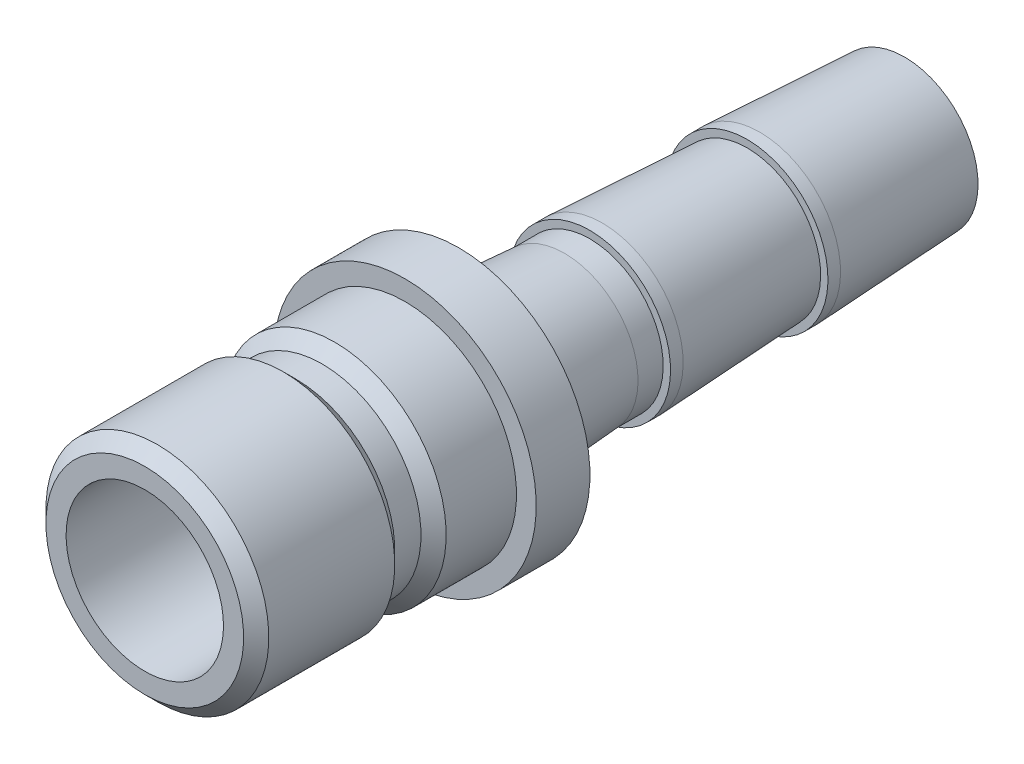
ISO-10303-21;
HEADER;
FILE_DESCRIPTION(('STEP AP214'),'2;1');
FILE_NAME('part.step','',(''),(''),'','','');
FILE_SCHEMA(('AUTOMOTIVE_DESIGN { 1 0 10303 214 1 1 1 1 }'));
ENDSEC;
DATA;
#1=APPLICATION_CONTEXT('core data for automotive mechanical design processes');
#2=APPLICATION_PROTOCOL_DEFINITION('international standard','automotive_design',2000,#1);
#3=PRODUCT_CONTEXT('',#1,'mechanical');
#4=PRODUCT('Part','Part','',(#3));
#5=PRODUCT_RELATED_PRODUCT_CATEGORY('part','',(#4));
#6=PRODUCT_DEFINITION_FORMATION('','',#4);
#7=PRODUCT_DEFINITION_CONTEXT('part definition',#1,'design');
#8=PRODUCT_DEFINITION('design','',#6,#7);
#9=PRODUCT_DEFINITION_SHAPE('','',#8);
#10=(LENGTH_UNIT() NAMED_UNIT(*) SI_UNIT(.MILLI.,.METRE.));
#11=(NAMED_UNIT(*) PLANE_ANGLE_UNIT() SI_UNIT($,.RADIAN.));
#12=(NAMED_UNIT(*) SI_UNIT($,.STERADIAN.) SOLID_ANGLE_UNIT());
#13=UNCERTAINTY_MEASURE_WITH_UNIT(LENGTH_MEASURE(1.E-05),#10,'distance_accuracy_value','');
#14=(GEOMETRIC_REPRESENTATION_CONTEXT(3) GLOBAL_UNCERTAINTY_ASSIGNED_CONTEXT((#13)) GLOBAL_UNIT_ASSIGNED_CONTEXT((#10,
#11,#12)) REPRESENTATION_CONTEXT('',''));
#15=CARTESIAN_POINT('',(0.,0.,0.));
#16=DIRECTION('',(0.,0.,1.));
#17=DIRECTION('',(1.,0.,0.));
#18=AXIS2_PLACEMENT_3D('',#15,#16,#17);
#19=CARTESIAN_POINT('',(0.,0.,0.));
#20=DIRECTION('',(0.,0.,-1.));
#21=DIRECTION('',(0.,1.,0.));
#22=AXIS2_PLACEMENT_3D('',#19,#20,#21);
#23=CYLINDRICAL_SURFACE('',#22,4.7625);
#24=CARTESIAN_POINT('',(0.,0.,3.556));
#25=DIRECTION('',(0.,0.,-1.));
#26=DIRECTION('',(0.,1.,0.));
#27=AXIS2_PLACEMENT_3D('',#24,#25,#26);
#28=CIRCLE('',#27,4.7625);
#29=CARTESIAN_POINT('',(0.,4.7625,3.556));
#30=VERTEX_POINT('',#29);
#31=EDGE_CURVE('E101',#30,#30,#28,.T.);
#32=ORIENTED_EDGE('',*,*,#31,.T.);
#33=EDGE_LOOP('',(#32));
#34=FACE_BOUND('',#33,.T.);
#35=CARTESIAN_POINT('',(0.,0.,15.748));
#36=DIRECTION('',(0.,0.,-1.));
#37=DIRECTION('',(0.,1.,0.));
#38=AXIS2_PLACEMENT_3D('',#35,#36,#37);
#39=CIRCLE('',#38,4.7625);
#40=CARTESIAN_POINT('',(0.,4.7625,15.748));
#41=VERTEX_POINT('',#40);
#42=EDGE_CURVE('E10',#41,#41,#39,.T.);
#43=ORIENTED_EDGE('',*,*,#42,.F.);
#44=EDGE_LOOP('',(#43));
#45=FACE_BOUND('',#44,.T.);
#46=ADVANCED_FACE('F31',(#34,#45),#23,.F.);
#47=CARTESIAN_POINT('',(0.,4.7625,15.748));
#48=DIRECTION('',(0.,0.,1.));
#49=DIRECTION('',(0.,-1.,0.));
#50=AXIS2_PLACEMENT_3D('',#47,#48,#49);
#51=PLANE('',#50);
#52=ORIENTED_EDGE('',*,*,#42,.T.);
#53=EDGE_LOOP('',(#52));
#54=FACE_BOUND('',#53,.T.);
#55=CARTESIAN_POINT('',(0.,0.,15.748));
#56=DIRECTION('',(0.,0.,-1.));
#57=DIRECTION('',(0.,1.,0.));
#58=AXIS2_PLACEMENT_3D('',#55,#56,#57);
#59=CIRCLE('',#58,5.9817);
#60=CARTESIAN_POINT('',(0.,5.9817,15.748));
#61=VERTEX_POINT('',#60);
#62=EDGE_CURVE('E37',#61,#61,#59,.T.);
#63=ORIENTED_EDGE('',*,*,#62,.F.);
#64=EDGE_LOOP('',(#63));
#65=FACE_BOUND('',#64,.T.);
#66=ADVANCED_FACE('F119',(#54,#65),#51,.T.);
#67=CARTESIAN_POINT('',(0.,0.,14.986));
#68=DIRECTION('',(0.,0.,-1.));
#69=DIRECTION('',(0.,1.,0.));
#70=AXIS2_PLACEMENT_3D('',#67,#68,#69);
#71=CONICAL_SURFACE('',#70,6.7437,0.785398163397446);
#72=ORIENTED_EDGE('',*,*,#62,.T.);
#73=EDGE_LOOP('',(#72));
#74=FACE_BOUND('',#73,.T.);
#75=CARTESIAN_POINT('',(0.,0.,14.986));
#76=DIRECTION('',(0.,0.,-1.));
#77=DIRECTION('',(0.,1.,0.));
#78=AXIS2_PLACEMENT_3D('',#75,#76,#77);
#79=CIRCLE('',#78,6.7437);
#80=CARTESIAN_POINT('',(0.,6.7437,14.986));
#81=VERTEX_POINT('',#80);
#82=EDGE_CURVE('E41',#81,#81,#79,.T.);
#83=ORIENTED_EDGE('',*,*,#82,.F.);
#84=EDGE_LOOP('',(#83));
#85=FACE_BOUND('',#84,.T.);
#86=ADVANCED_FACE('F123',(#74,#85),#71,.T.);
#87=CARTESIAN_POINT('',(0.,0.,0.));
#88=DIRECTION('',(0.,0.,-1.));
#89=DIRECTION('',(0.,1.,0.));
#90=AXIS2_PLACEMENT_3D('',#87,#88,#89);
#91=CYLINDRICAL_SURFACE('',#90,6.7437);
#92=ORIENTED_EDGE('',*,*,#82,.T.);
#93=EDGE_LOOP('',(#92));
#94=FACE_BOUND('',#93,.T.);
#95=CARTESIAN_POINT('',(0.,0.,7.36599999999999));
#96=DIRECTION('',(0.,0.,-1.));
#97=DIRECTION('',(0.,1.,0.));
#98=AXIS2_PLACEMENT_3D('',#95,#96,#97);
#99=CIRCLE('',#98,6.7437);
#100=CARTESIAN_POINT('',(0.,6.7437,7.36599999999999));
#101=VERTEX_POINT('',#100);
#102=EDGE_CURVE('E45',#101,#101,#99,.T.);
#103=ORIENTED_EDGE('',*,*,#102,.F.);
#104=EDGE_LOOP('',(#103));
#105=FACE_BOUND('',#104,.T.);
#106=ADVANCED_FACE('F127',(#94,#105),#91,.T.);
#107=CARTESIAN_POINT('',(0.,0.,6.604));
#108=DIRECTION('',(0.,0.,1.));
#109=DIRECTION('',(0.,-1.,0.));
#110=AXIS2_PLACEMENT_3D('',#107,#108,#109);
#111=CONICAL_SURFACE('',#110,5.9817,0.785398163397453);
#112=ORIENTED_EDGE('',*,*,#102,.T.);
#113=EDGE_LOOP('',(#112));
#114=FACE_BOUND('',#113,.T.);
#115=CARTESIAN_POINT('',(0.,0.,6.604));
#116=DIRECTION('',(0.,0.,-1.));
#117=DIRECTION('',(0.,1.,0.));
#118=AXIS2_PLACEMENT_3D('',#115,#116,#117);
#119=CIRCLE('',#118,5.9817);
#120=CARTESIAN_POINT('',(0.,5.9817,6.604));
#121=VERTEX_POINT('',#120);
#122=EDGE_CURVE('E50',#121,#121,#119,.T.);
#123=ORIENTED_EDGE('',*,*,#122,.F.);
#124=EDGE_LOOP('',(#123));
#125=FACE_BOUND('',#124,.T.);
#126=ADVANCED_FACE('F133',(#114,#125),#111,.T.);
#127=CARTESIAN_POINT('',(0.,0.,0.));
#128=DIRECTION('',(0.,0.,-1.));
#129=DIRECTION('',(0.,1.,0.));
#130=AXIS2_PLACEMENT_3D('',#127,#128,#129);
#131=CYLINDRICAL_SURFACE('',#130,5.9817);
#132=ORIENTED_EDGE('',*,*,#122,.T.);
#133=EDGE_LOOP('',(#132));
#134=FACE_BOUND('',#133,.T.);
#135=CARTESIAN_POINT('',(0.,0.,5.0165));
#136=DIRECTION('',(0.,0.,-1.));
#137=DIRECTION('',(0.,1.,0.));
#138=AXIS2_PLACEMENT_3D('',#135,#136,#137);
#139=CIRCLE('',#138,5.9817);
#140=CARTESIAN_POINT('',(0.,5.9817,5.0165));
#141=VERTEX_POINT('',#140);
#142=EDGE_CURVE('E53',#141,#141,#139,.T.);
#143=ORIENTED_EDGE('',*,*,#142,.F.);
#144=EDGE_LOOP('',(#143));
#145=FACE_BOUND('',#144,.T.);
#146=ADVANCED_FACE('F137',(#134,#145),#131,.T.);
#147=CARTESIAN_POINT('',(0.,0.,4.25449999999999));
#148=DIRECTION('',(0.,0.,-1.));
#149=DIRECTION('',(0.,1.,0.));
#150=AXIS2_PLACEMENT_3D('',#147,#148,#149);
#151=CONICAL_SURFACE('',#150,6.7437,0.785398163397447);
#152=ORIENTED_EDGE('',*,*,#142,.T.);
#153=EDGE_LOOP('',(#152));
#154=FACE_BOUND('',#153,.T.);
#155=CARTESIAN_POINT('',(0.,0.,4.25449999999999));
#156=DIRECTION('',(0.,0.,-1.));
#157=DIRECTION('',(0.,1.,0.));
#158=AXIS2_PLACEMENT_3D('',#155,#156,#157);
#159=CIRCLE('',#158,6.7437);
#160=CARTESIAN_POINT('',(0.,6.7437,4.25449999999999));
#161=VERTEX_POINT('',#160);
#162=EDGE_CURVE('E56',#161,#161,#159,.T.);
#163=ORIENTED_EDGE('',*,*,#162,.F.);
#164=EDGE_LOOP('',(#163));
#165=FACE_BOUND('',#164,.T.);
#166=ADVANCED_FACE('F141',(#154,#165),#151,.T.);
#167=CARTESIAN_POINT('',(0.,0.,0.));
#168=DIRECTION('',(0.,0.,-1.));
#169=DIRECTION('',(0.,1.,0.));
#170=AXIS2_PLACEMENT_3D('',#167,#168,#169);
#171=CYLINDRICAL_SURFACE('',#170,6.7437);
#172=ORIENTED_EDGE('',*,*,#162,.T.);
#173=EDGE_LOOP('',(#172));
#174=FACE_BOUND('',#173,.T.);
#175=CARTESIAN_POINT('',(0.,0.,0.));
#176=DIRECTION('',(0.,0.,-1.));
#177=DIRECTION('',(0.,1.,0.));
#178=AXIS2_PLACEMENT_3D('',#175,#176,#177);
#179=CIRCLE('',#178,6.7437);
#180=CARTESIAN_POINT('',(0.,6.7437,0.));
#181=VERTEX_POINT('',#180);
#182=EDGE_CURVE('E59',#181,#181,#179,.T.);
#183=ORIENTED_EDGE('',*,*,#182,.F.);
#184=EDGE_LOOP('',(#183));
#185=FACE_BOUND('',#184,.T.);
#186=ADVANCED_FACE('F145',(#174,#185),#171,.T.);
#187=CARTESIAN_POINT('',(0.,6.7437,0.));
#188=DIRECTION('',(0.,0.,1.));
#189=DIRECTION('',(0.,-1.,0.));
#190=AXIS2_PLACEMENT_3D('',#187,#188,#189);
#191=PLANE('',#190);
#192=ORIENTED_EDGE('',*,*,#182,.T.);
#193=EDGE_LOOP('',(#192));
#194=FACE_BOUND('',#193,.T.);
#195=CARTESIAN_POINT('',(0.,0.,0.));
#196=DIRECTION('',(0.,0.,-1.));
#197=DIRECTION('',(0.,1.,0.));
#198=AXIS2_PLACEMENT_3D('',#195,#196,#197);
#199=CIRCLE('',#198,7.9375);
#200=CARTESIAN_POINT('',(0.,7.9375,0.));
#201=VERTEX_POINT('',#200);
#202=EDGE_CURVE('E62',#201,#201,#199,.T.);
#203=ORIENTED_EDGE('',*,*,#202,.F.);
#204=EDGE_LOOP('',(#203));
#205=FACE_BOUND('',#204,.T.);
#206=ADVANCED_FACE('F149',(#194,#205),#191,.T.);
#207=CARTESIAN_POINT('',(0.,0.,0.));
#208=DIRECTION('',(0.,0.,-1.));
#209=DIRECTION('',(0.,1.,0.));
#210=AXIS2_PLACEMENT_3D('',#207,#208,#209);
#211=CYLINDRICAL_SURFACE('',#210,7.9375);
#212=ORIENTED_EDGE('',*,*,#202,.T.);
#213=EDGE_LOOP('',(#212));
#214=FACE_BOUND('',#213,.T.);
#215=CARTESIAN_POINT('',(0.,0.,-3.2512));
#216=DIRECTION('',(0.,0.,-1.));
#217=DIRECTION('',(0.,1.,0.));
#218=AXIS2_PLACEMENT_3D('',#215,#216,#217);
#219=CIRCLE('',#218,7.9375);
#220=CARTESIAN_POINT('',(0.,7.9375,-3.2512));
#221=VERTEX_POINT('',#220);
#222=EDGE_CURVE('E65',#221,#221,#219,.T.);
#223=ORIENTED_EDGE('',*,*,#222,.F.);
#224=EDGE_LOOP('',(#223));
#225=FACE_BOUND('',#224,.T.);
#226=ADVANCED_FACE('F153',(#214,#225),#211,.T.);
#227=CARTESIAN_POINT('',(0.,4.8895,-3.2512));
#228=DIRECTION('',(0.,0.,-1.));
#229=DIRECTION('',(0.,1.,0.));
#230=AXIS2_PLACEMENT_3D('',#227,#228,#229);
#231=PLANE('',#230);
#232=ORIENTED_EDGE('',*,*,#222,.T.);
#233=EDGE_LOOP('',(#232));
#234=FACE_BOUND('',#233,.T.);
#235=CARTESIAN_POINT('',(0.,0.,-3.2512));
#236=DIRECTION('',(0.,0.,-1.));
#237=DIRECTION('',(0.,1.,0.));
#238=AXIS2_PLACEMENT_3D('',#235,#236,#237);
#239=CIRCLE('',#238,4.8895);
#240=CARTESIAN_POINT('',(0.,4.8895,-3.2512));
#241=VERTEX_POINT('',#240);
#242=EDGE_CURVE('E68',#241,#241,#239,.T.);
#243=ORIENTED_EDGE('',*,*,#242,.F.);
#244=EDGE_LOOP('',(#243));
#245=FACE_BOUND('',#244,.T.);
#246=ADVANCED_FACE('F157',(#234,#245),#231,.T.);
#247=CARTESIAN_POINT('',(0.,0.,-9.652));
#248=DIRECTION('',(0.,0.,1.));
#249=DIRECTION('',(0.,-1.,0.));
#250=AXIS2_PLACEMENT_3D('',#247,#248,#249);
#251=CONICAL_SURFACE('',#250,4.445,0.0693331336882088);
#252=ORIENTED_EDGE('',*,*,#242,.T.);
#253=EDGE_LOOP('',(#252));
#254=FACE_BOUND('',#253,.T.);
#255=CARTESIAN_POINT('',(0.,0.,-9.652));
#256=DIRECTION('',(0.,0.,-1.));
#257=DIRECTION('',(0.,1.,0.));
#258=AXIS2_PLACEMENT_3D('',#255,#256,#257);
#259=CIRCLE('',#258,4.445);
#260=CARTESIAN_POINT('',(0.,4.445,-9.652));
#261=VERTEX_POINT('',#260);
#262=EDGE_CURVE('E71',#261,#261,#259,.T.);
#263=ORIENTED_EDGE('',*,*,#262,.F.);
#264=EDGE_LOOP('',(#263));
#265=FACE_BOUND('',#264,.T.);
#266=ADVANCED_FACE('F161',(#254,#265),#251,.T.);
#267=CARTESIAN_POINT('',(0.,0.,0.));
#268=DIRECTION('',(0.,0.,-1.));
#269=DIRECTION('',(0.,1.,0.));
#270=AXIS2_PLACEMENT_3D('',#267,#268,#269);
#271=CYLINDRICAL_SURFACE('',#270,4.445);
#272=ORIENTED_EDGE('',*,*,#262,.T.);
#273=EDGE_LOOP('',(#272));
#274=FACE_BOUND('',#273,.T.);
#275=CARTESIAN_POINT('',(0.,0.,-11.176));
#276=DIRECTION('',(0.,0.,-1.));
#277=DIRECTION('',(0.,1.,0.));
#278=AXIS2_PLACEMENT_3D('',#275,#276,#277);
#279=CIRCLE('',#278,4.445);
#280=CARTESIAN_POINT('',(0.,4.445,-11.176));
#281=VERTEX_POINT('',#280);
#282=EDGE_CURVE('E74',#281,#281,#279,.T.);
#283=ORIENTED_EDGE('',*,*,#282,.F.);
#284=EDGE_LOOP('',(#283));
#285=FACE_BOUND('',#284,.T.);
#286=ADVANCED_FACE('F165',(#274,#285),#271,.T.);
#287=CARTESIAN_POINT('',(0.,4.8895,-11.176));
#288=DIRECTION('',(0.,0.,1.));
#289=DIRECTION('',(0.,-1.,0.));
#290=AXIS2_PLACEMENT_3D('',#287,#288,#289);
#291=PLANE('',#290);
#292=ORIENTED_EDGE('',*,*,#282,.T.);
#293=EDGE_LOOP('',(#292));
#294=FACE_BOUND('',#293,.T.);
#295=CARTESIAN_POINT('',(0.,0.,-11.176));
#296=DIRECTION('',(0.,0.,-1.));
#297=DIRECTION('',(0.,1.,0.));
#298=AXIS2_PLACEMENT_3D('',#295,#296,#297);
#299=CIRCLE('',#298,4.8895);
#300=CARTESIAN_POINT('',(0.,4.8895,-11.176));
#301=VERTEX_POINT('',#300);
#302=EDGE_CURVE('E77',#301,#301,#299,.T.);
#303=ORIENTED_EDGE('',*,*,#302,.F.);
#304=EDGE_LOOP('',(#303));
#305=FACE_BOUND('',#304,.T.);
#306=ADVANCED_FACE('F169',(#294,#305),#291,.T.);
#307=CARTESIAN_POINT('',(0.,0.,0.));
#308=DIRECTION('',(0.,0.,-1.));
#309=DIRECTION('',(0.,1.,0.));
#310=AXIS2_PLACEMENT_3D('',#307,#308,#309);
#311=CYLINDRICAL_SURFACE('',#310,4.8895);
#312=ORIENTED_EDGE('',*,*,#302,.T.);
#313=EDGE_LOOP('',(#312));
#314=FACE_BOUND('',#313,.T.);
#315=CARTESIAN_POINT('',(0.,0.,-11.938));
#316=DIRECTION('',(0.,0.,-1.));
#317=DIRECTION('',(0.,1.,0.));
#318=AXIS2_PLACEMENT_3D('',#315,#316,#317);
#319=CIRCLE('',#318,4.8895);
#320=CARTESIAN_POINT('',(0.,4.8895,-11.938));
#321=VERTEX_POINT('',#320);
#322=EDGE_CURVE('E80',#321,#321,#319,.T.);
#323=ORIENTED_EDGE('',*,*,#322,.F.);
#324=EDGE_LOOP('',(#323));
#325=FACE_BOUND('',#324,.T.);
#326=ADVANCED_FACE('F173',(#314,#325),#311,.T.);
#327=CARTESIAN_POINT('',(0.,0.,-20.701));
#328=DIRECTION('',(0.,0.,1.));
#329=DIRECTION('',(0.,-1.,0.));
#330=AXIS2_PLACEMENT_3D('',#327,#328,#329);
#331=CONICAL_SURFACE('',#330,4.445,0.0506812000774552);
#332=ORIENTED_EDGE('',*,*,#322,.T.);
#333=EDGE_LOOP('',(#332));
#334=FACE_BOUND('',#333,.T.);
#335=CARTESIAN_POINT('',(0.,0.,-20.701));
#336=DIRECTION('',(0.,0.,-1.));
#337=DIRECTION('',(0.,1.,0.));
#338=AXIS2_PLACEMENT_3D('',#335,#336,#337);
#339=CIRCLE('',#338,4.445);
#340=CARTESIAN_POINT('',(0.,4.445,-20.701));
#341=VERTEX_POINT('',#340);
#342=EDGE_CURVE('E83',#341,#341,#339,.T.);
#343=ORIENTED_EDGE('',*,*,#342,.F.);
#344=EDGE_LOOP('',(#343));
#345=FACE_BOUND('',#344,.T.);
#346=ADVANCED_FACE('F177',(#334,#345),#331,.T.);
#347=CARTESIAN_POINT('',(0.,4.8895,-20.701));
#348=DIRECTION('',(0.,0.,1.));
#349=DIRECTION('',(0.,-1.,0.));
#350=AXIS2_PLACEMENT_3D('',#347,#348,#349);
#351=PLANE('',#350);
#352=ORIENTED_EDGE('',*,*,#342,.T.);
#353=EDGE_LOOP('',(#352));
#354=FACE_BOUND('',#353,.T.);
#355=CARTESIAN_POINT('',(0.,0.,-20.701));
#356=DIRECTION('',(0.,0.,-1.));
#357=DIRECTION('',(0.,1.,0.));
#358=AXIS2_PLACEMENT_3D('',#355,#356,#357);
#359=CIRCLE('',#358,4.8895);
#360=CARTESIAN_POINT('',(0.,4.8895,-20.701));
#361=VERTEX_POINT('',#360);
#362=EDGE_CURVE('E86',#361,#361,#359,.T.);
#363=ORIENTED_EDGE('',*,*,#362,.F.);
#364=EDGE_LOOP('',(#363));
#365=FACE_BOUND('',#364,.T.);
#366=ADVANCED_FACE('F181',(#354,#365),#351,.T.);
#367=CARTESIAN_POINT('',(0.,0.,0.));
#368=DIRECTION('',(0.,0.,-1.));
#369=DIRECTION('',(0.,1.,0.));
#370=AXIS2_PLACEMENT_3D('',#367,#368,#369);
#371=CYLINDRICAL_SURFACE('',#370,4.8895);
#372=ORIENTED_EDGE('',*,*,#362,.T.);
#373=EDGE_LOOP('',(#372));
#374=FACE_BOUND('',#373,.T.);
#375=CARTESIAN_POINT('',(0.,0.,-21.463));
#376=DIRECTION('',(0.,0.,-1.));
#377=DIRECTION('',(0.,1.,0.));
#378=AXIS2_PLACEMENT_3D('',#375,#376,#377);
#379=CIRCLE('',#378,4.8895);
#380=CARTESIAN_POINT('',(0.,4.8895,-21.463));
#381=VERTEX_POINT('',#380);
#382=EDGE_CURVE('E89',#381,#381,#379,.T.);
#383=ORIENTED_EDGE('',*,*,#382,.F.);
#384=EDGE_LOOP('',(#383));
#385=FACE_BOUND('',#384,.T.);
#386=ADVANCED_FACE('F185',(#374,#385),#371,.T.);
#387=CARTESIAN_POINT('',(0.,0.,-30.226));
#388=DIRECTION('',(0.,0.,1.));
#389=DIRECTION('',(0.,-1.,0.));
#390=AXIS2_PLACEMENT_3D('',#387,#388,#389);
#391=CONICAL_SURFACE('',#390,4.44499999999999,0.0506812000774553);
#392=ORIENTED_EDGE('',*,*,#382,.T.);
#393=EDGE_LOOP('',(#392));
#394=FACE_BOUND('',#393,.T.);
#395=CARTESIAN_POINT('',(0.,0.,-30.226));
#396=DIRECTION('',(0.,0.,-1.));
#397=DIRECTION('',(0.,1.,0.));
#398=AXIS2_PLACEMENT_3D('',#395,#396,#397);
#399=CIRCLE('',#398,4.44499999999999);
#400=CARTESIAN_POINT('',(0.,4.445,-30.226));
#401=VERTEX_POINT('',#400);
#402=EDGE_CURVE('E92',#401,#401,#399,.T.);
#403=ORIENTED_EDGE('',*,*,#402,.F.);
#404=EDGE_LOOP('',(#403));
#405=FACE_BOUND('',#404,.T.);
#406=ADVANCED_FACE('F189',(#394,#405),#391,.T.);
#407=CARTESIAN_POINT('',(0.,4.445,-30.226));
#408=DIRECTION('',(0.,0.,-1.));
#409=DIRECTION('',(0.,1.,0.));
#410=AXIS2_PLACEMENT_3D('',#407,#408,#409);
#411=PLANE('',#410);
#412=ORIENTED_EDGE('',*,*,#402,.T.);
#413=EDGE_LOOP('',(#412));
#414=FACE_BOUND('',#413,.T.);
#415=CARTESIAN_POINT('',(0.,0.,-30.226));
#416=DIRECTION('',(0.,0.,-1.));
#417=DIRECTION('',(0.,1.,0.));
#418=AXIS2_PLACEMENT_3D('',#415,#416,#417);
#419=CIRCLE('',#418,3.571875);
#420=CARTESIAN_POINT('',(0.,3.571875,-30.226));
#421=VERTEX_POINT('',#420);
#422=EDGE_CURVE('E95',#421,#421,#419,.T.);
#423=ORIENTED_EDGE('',*,*,#422,.F.);
#424=EDGE_LOOP('',(#423));
#425=FACE_BOUND('',#424,.T.);
#426=ADVANCED_FACE('F115',(#414,#425),#411,.T.);
#427=CARTESIAN_POINT('',(0.,0.,0.));
#428=DIRECTION('',(0.,0.,-1.));
#429=DIRECTION('',(0.,1.,0.));
#430=AXIS2_PLACEMENT_3D('',#427,#428,#429);
#431=CYLINDRICAL_SURFACE('',#430,3.571875);
#432=ORIENTED_EDGE('',*,*,#422,.T.);
#433=EDGE_LOOP('',(#432));
#434=FACE_BOUND('',#433,.T.);
#435=CARTESIAN_POINT('',(0.,0.,0.691870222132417));
#436=DIRECTION('',(0.,0.,-1.));
#437=DIRECTION('',(0.,1.,0.));
#438=AXIS2_PLACEMENT_3D('',#435,#436,#437);
#439=CIRCLE('',#438,3.571875);
#440=CARTESIAN_POINT('',(0.,3.571875,0.691870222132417));
#441=VERTEX_POINT('',#440);
#442=EDGE_CURVE('E98',#441,#441,#439,.T.);
#443=ORIENTED_EDGE('',*,*,#442,.F.);
#444=EDGE_LOOP('',(#443));
#445=FACE_BOUND('',#444,.T.);
#446=ADVANCED_FACE('F109',(#434,#445),#431,.F.);
#447=CARTESIAN_POINT('',(0.,0.,3.556));
#448=DIRECTION('',(0.,0.,1.));
#449=DIRECTION('',(0.,-1.,0.));
#450=AXIS2_PLACEMENT_3D('',#447,#448,#449);
#451=CONICAL_SURFACE('',#450,4.7625,0.393969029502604);
#452=ORIENTED_EDGE('',*,*,#442,.T.);
#453=EDGE_LOOP('',(#452));
#454=FACE_BOUND('',#453,.T.);
#455=ORIENTED_EDGE('',*,*,#31,.F.);
#456=EDGE_LOOP('',(#455));
#457=FACE_BOUND('',#456,.T.);
#458=ADVANCED_FACE('F107',(#454,#457),#451,.F.);
#459=CLOSED_SHELL('',(#46,#66,#86,#106,#126,#146,#166,#186,#206,#226,#246,#266,#286,#306,#326,
#346,#366,#386,#406,#426,#446,#458));
#460=MANIFOLD_SOLID_BREP('B2',#459);
#461=ADVANCED_BREP_SHAPE_REPRESENTATION('',(#18,#460),#14);
#462=SHAPE_DEFINITION_REPRESENTATION(#9,#461);
ENDSEC;
END-ISO-10303-21;
